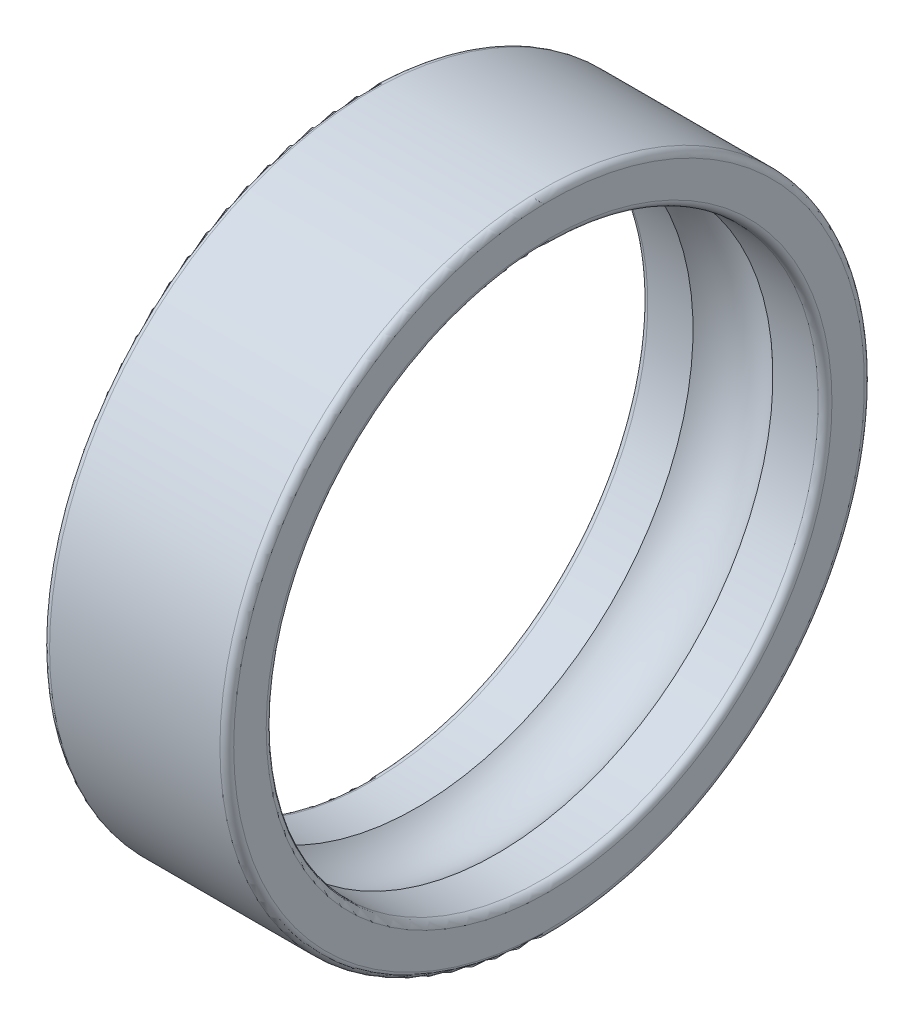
ISO-10303-21;
HEADER;
FILE_DESCRIPTION(('STEP AP214'),'2;1');
FILE_NAME('part.step','',(''),(''),'','','');
FILE_SCHEMA(('AUTOMOTIVE_DESIGN { 1 0 10303 214 1 1 1 1 }'));
ENDSEC;
DATA;
#1=APPLICATION_CONTEXT('core data for automotive mechanical design processes');
#2=APPLICATION_PROTOCOL_DEFINITION('international standard','automotive_design',2000,#1);
#3=PRODUCT_CONTEXT('',#1,'mechanical');
#4=PRODUCT('Part','Part','',(#3));
#5=PRODUCT_RELATED_PRODUCT_CATEGORY('part','',(#4));
#6=PRODUCT_DEFINITION_FORMATION('','',#4);
#7=PRODUCT_DEFINITION_CONTEXT('part definition',#1,'design');
#8=PRODUCT_DEFINITION('design','',#6,#7);
#9=PRODUCT_DEFINITION_SHAPE('','',#8);
#10=(LENGTH_UNIT() NAMED_UNIT(*) SI_UNIT(.MILLI.,.METRE.));
#11=(NAMED_UNIT(*) PLANE_ANGLE_UNIT() SI_UNIT($,.RADIAN.));
#12=(NAMED_UNIT(*) SI_UNIT($,.STERADIAN.) SOLID_ANGLE_UNIT());
#13=UNCERTAINTY_MEASURE_WITH_UNIT(LENGTH_MEASURE(1.E-05),#10,'distance_accuracy_value','');
#14=(GEOMETRIC_REPRESENTATION_CONTEXT(3) GLOBAL_UNCERTAINTY_ASSIGNED_CONTEXT((#13)) GLOBAL_UNIT_ASSIGNED_CONTEXT((#10,
#11,#12)) REPRESENTATION_CONTEXT('',''));
#15=CARTESIAN_POINT('',(0.,0.,0.));
#16=DIRECTION('',(0.,0.,1.));
#17=DIRECTION('',(1.,0.,0.));
#18=AXIS2_PLACEMENT_3D('',#15,#16,#17);
#19=CARTESIAN_POINT('',(-7.7,0.,0.));
#20=DIRECTION('',(-1.,0.,0.));
#21=DIRECTION('',(0.,0.,1.));
#22=AXIS2_PLACEMENT_3D('',#19,#20,#21);
#23=TOROIDAL_SURFACE('',#22,13.7,0.3);
#24=CARTESIAN_POINT('',(-8.,0.,0.));
#25=DIRECTION('',(-1.,0.,0.));
#26=DIRECTION('',(0.,0.,1.));
#27=AXIS2_PLACEMENT_3D('',#24,#25,#26);
#28=CIRCLE('',#27,13.7);
#29=CARTESIAN_POINT('',(-8.,0.,13.7));
#30=VERTEX_POINT('',#29);
#31=EDGE_CURVE('E388',#30,#30,#28,.T.);
#32=ORIENTED_EDGE('',*,*,#31,.F.);
#33=EDGE_LOOP('',(#32));
#34=FACE_BOUND('',#33,.T.);
#35=CARTESIAN_POINT('',(-7.7,0.,0.));
#36=DIRECTION('',(-1.,0.,0.));
#37=DIRECTION('',(0.,0.,1.));
#38=AXIS2_PLACEMENT_3D('',#35,#36,#37);
#39=CIRCLE('',#38,14.);
#40=CARTESIAN_POINT('',(-7.7,0.,14.));
#41=VERTEX_POINT('',#40);
#42=EDGE_CURVE('E10',#41,#41,#39,.T.);
#43=ORIENTED_EDGE('',*,*,#42,.T.);
#44=EDGE_LOOP('',(#43));
#45=FACE_BOUND('',#44,.T.);
#46=ADVANCED_FACE('F354',(#34,#45),#23,.T.);
#47=CARTESIAN_POINT('',(-60.,0.,0.));
#48=DIRECTION('',(-1.,0.,0.));
#49=DIRECTION('',(0.,0.,1.));
#50=AXIS2_PLACEMENT_3D('',#47,#48,#49);
#51=CYLINDRICAL_SURFACE('',#50,14.);
#52=ORIENTED_EDGE('',*,*,#42,.F.);
#53=EDGE_LOOP('',(#52));
#54=FACE_BOUND('',#53,.T.);
#55=CARTESIAN_POINT('',(-0.300000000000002,0.,0.));
#56=DIRECTION('',(-1.,0.,0.));
#57=DIRECTION('',(0.,0.,1.));
#58=AXIS2_PLACEMENT_3D('',#55,#56,#57);
#59=CIRCLE('',#58,14.);
#60=CARTESIAN_POINT('',(-0.300000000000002,0.,14.));
#61=VERTEX_POINT('',#60);
#62=EDGE_CURVE('E360',#61,#61,#59,.T.);
#63=ORIENTED_EDGE('',*,*,#62,.T.);
#64=EDGE_LOOP('',(#63));
#65=FACE_BOUND('',#64,.T.);
#66=ADVANCED_FACE('F395',(#54,#65),#51,.T.);
#67=CARTESIAN_POINT('',(-0.300000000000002,0.,0.));
#68=DIRECTION('',(-1.,0.,0.));
#69=DIRECTION('',(0.,0.,1.));
#70=AXIS2_PLACEMENT_3D('',#67,#68,#69);
#71=TOROIDAL_SURFACE('',#70,13.7,0.3);
#72=ORIENTED_EDGE('',*,*,#62,.F.);
#73=EDGE_LOOP('',(#72));
#74=FACE_BOUND('',#73,.T.);
#75=CARTESIAN_POINT('',(0.,0.,0.));
#76=DIRECTION('',(-1.,0.,0.));
#77=DIRECTION('',(0.,0.,1.));
#78=AXIS2_PLACEMENT_3D('',#75,#76,#77);
#79=CIRCLE('',#78,13.7);
#80=CARTESIAN_POINT('',(0.,0.,13.7));
#81=VERTEX_POINT('',#80);
#82=EDGE_CURVE('E364',#81,#81,#79,.T.);
#83=ORIENTED_EDGE('',*,*,#82,.T.);
#84=EDGE_LOOP('',(#83));
#85=FACE_BOUND('',#84,.T.);
#86=ADVANCED_FACE('F399',(#74,#85),#71,.T.);
#87=CARTESIAN_POINT('',(0.,13.7,0.));
#88=DIRECTION('',(-1.,0.,0.));
#89=DIRECTION('',(0.,0.,1.));
#90=AXIS2_PLACEMENT_3D('',#87,#88,#89);
#91=PLANE('',#90);
#92=ORIENTED_EDGE('',*,*,#82,.F.);
#93=EDGE_LOOP('',(#92));
#94=FACE_BOUND('',#93,.T.);
#95=CARTESIAN_POINT('',(0.,0.,0.));
#96=DIRECTION('',(-1.,0.,0.));
#97=DIRECTION('',(0.,0.,1.));
#98=AXIS2_PLACEMENT_3D('',#95,#96,#97);
#99=CIRCLE('',#98,12.2894776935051);
#100=CARTESIAN_POINT('',(0.,0.,12.2894776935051));
#101=VERTEX_POINT('',#100);
#102=EDGE_CURVE('E368',#101,#101,#99,.T.);
#103=ORIENTED_EDGE('',*,*,#102,.T.);
#104=EDGE_LOOP('',(#103));
#105=FACE_BOUND('',#104,.T.);
#106=ADVANCED_FACE('F404',(#94,#105),#91,.F.);
#107=CARTESIAN_POINT('',(-0.300000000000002,0.,0.));
#108=DIRECTION('',(-1.,0.,0.));
#109=DIRECTION('',(0.,0.,1.));
#110=AXIS2_PLACEMENT_3D('',#107,#108,#109);
#111=TOROIDAL_SURFACE('',#110,12.2894776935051,0.3);
#112=ORIENTED_EDGE('',*,*,#102,.F.);
#113=EDGE_LOOP('',(#112));
#114=FACE_BOUND('',#113,.T.);
#115=CARTESIAN_POINT('',(-0.300000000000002,0.,0.));
#116=DIRECTION('',(-1.,0.,0.));
#117=DIRECTION('',(0.,0.,1.));
#118=AXIS2_PLACEMENT_3D('',#115,#116,#117);
#119=CIRCLE('',#118,11.9894776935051);
#120=CARTESIAN_POINT('',(-0.300000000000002,0.,11.9894776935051));
#121=VERTEX_POINT('',#120);
#122=EDGE_CURVE('E373',#121,#121,#119,.T.);
#123=ORIENTED_EDGE('',*,*,#122,.T.);
#124=EDGE_LOOP('',(#123));
#125=FACE_BOUND('',#124,.T.);
#126=ADVANCED_FACE('F410',(#114,#125),#111,.T.);
#127=CARTESIAN_POINT('',(-60.,0.,0.));
#128=DIRECTION('',(-1.,0.,0.));
#129=DIRECTION('',(0.,0.,1.));
#130=AXIS2_PLACEMENT_3D('',#127,#128,#129);
#131=CYLINDRICAL_SURFACE('',#130,11.9894776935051);
#132=ORIENTED_EDGE('',*,*,#122,.F.);
#133=EDGE_LOOP('',(#132));
#134=FACE_BOUND('',#133,.T.);
#135=CARTESIAN_POINT('',(-2.26506484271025,0.,0.));
#136=DIRECTION('',(-1.,0.,0.));
#137=DIRECTION('',(0.,0.,1.));
#138=AXIS2_PLACEMENT_3D('',#135,#136,#137);
#139=CIRCLE('',#138,11.9894776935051);
#140=CARTESIAN_POINT('',(-2.26506484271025,0.,11.9894776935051));
#141=VERTEX_POINT('',#140);
#142=EDGE_CURVE('E376',#141,#141,#139,.T.);
#143=ORIENTED_EDGE('',*,*,#142,.T.);
#144=EDGE_LOOP('',(#143));
#145=FACE_BOUND('',#144,.T.);
#146=ADVANCED_FACE('F414',(#134,#145),#131,.F.);
#147=CARTESIAN_POINT('',(-4.,0.,0.));
#148=DIRECTION('',(-1.,0.,0.));
#149=DIRECTION('',(0.,0.,1.));
#150=AXIS2_PLACEMENT_3D('',#147,#148,#149);
#151=TOROIDAL_SURFACE('',#150,10.1894776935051,2.5);
#152=ORIENTED_EDGE('',*,*,#142,.F.);
#153=EDGE_LOOP('',(#152));
#154=FACE_BOUND('',#153,.T.);
#155=CARTESIAN_POINT('',(-5.73493515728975,0.,0.));
#156=DIRECTION('',(-1.,0.,0.));
#157=DIRECTION('',(0.,0.,1.));
#158=AXIS2_PLACEMENT_3D('',#155,#156,#157);
#159=CIRCLE('',#158,11.9894776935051);
#160=CARTESIAN_POINT('',(-5.73493515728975,0.,11.9894776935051));
#161=VERTEX_POINT('',#160);
#162=EDGE_CURVE('E379',#161,#161,#159,.T.);
#163=ORIENTED_EDGE('',*,*,#162,.T.);
#164=EDGE_LOOP('',(#163));
#165=FACE_BOUND('',#164,.T.);
#166=ADVANCED_FACE('F418',(#154,#165),#151,.F.);
#167=CARTESIAN_POINT('',(-60.,0.,0.));
#168=DIRECTION('',(-1.,0.,0.));
#169=DIRECTION('',(0.,0.,1.));
#170=AXIS2_PLACEMENT_3D('',#167,#168,#169);
#171=CYLINDRICAL_SURFACE('',#170,11.9894776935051);
#172=ORIENTED_EDGE('',*,*,#162,.F.);
#173=EDGE_LOOP('',(#172));
#174=FACE_BOUND('',#173,.T.);
#175=CARTESIAN_POINT('',(-7.7,0.,0.));
#176=DIRECTION('',(-1.,0.,0.));
#177=DIRECTION('',(0.,0.,1.));
#178=AXIS2_PLACEMENT_3D('',#175,#176,#177);
#179=CIRCLE('',#178,11.9894776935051);
#180=CARTESIAN_POINT('',(-7.7,0.,11.9894776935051));
#181=VERTEX_POINT('',#180);
#182=EDGE_CURVE('E382',#181,#181,#179,.T.);
#183=ORIENTED_EDGE('',*,*,#182,.T.);
#184=EDGE_LOOP('',(#183));
#185=FACE_BOUND('',#184,.T.);
#186=ADVANCED_FACE('F422',(#174,#185),#171,.F.);
#187=CARTESIAN_POINT('',(-7.7,0.,0.));
#188=DIRECTION('',(-1.,0.,0.));
#189=DIRECTION('',(0.,0.,1.));
#190=AXIS2_PLACEMENT_3D('',#187,#188,#189);
#191=TOROIDAL_SURFACE('',#190,12.2894776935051,0.3);
#192=ORIENTED_EDGE('',*,*,#182,.F.);
#193=EDGE_LOOP('',(#192));
#194=FACE_BOUND('',#193,.T.);
#195=CARTESIAN_POINT('',(-8.,0.,0.));
#196=DIRECTION('',(-1.,0.,0.));
#197=DIRECTION('',(0.,0.,1.));
#198=AXIS2_PLACEMENT_3D('',#195,#196,#197);
#199=CIRCLE('',#198,12.2894776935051);
#200=CARTESIAN_POINT('',(-8.,0.,12.2894776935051));
#201=VERTEX_POINT('',#200);
#202=EDGE_CURVE('E385',#201,#201,#199,.T.);
#203=ORIENTED_EDGE('',*,*,#202,.T.);
#204=EDGE_LOOP('',(#203));
#205=FACE_BOUND('',#204,.T.);
#206=ADVANCED_FACE('F426',(#194,#205),#191,.T.);
#207=CARTESIAN_POINT('',(-8.,13.7,0.));
#208=DIRECTION('',(1.,0.,0.));
#209=DIRECTION('',(0.,0.,-1.));
#210=AXIS2_PLACEMENT_3D('',#207,#208,#209);
#211=PLANE('',#210);
#212=ORIENTED_EDGE('',*,*,#202,.F.);
#213=EDGE_LOOP('',(#212));
#214=FACE_BOUND('',#213,.T.);
#215=ORIENTED_EDGE('',*,*,#31,.T.);
#216=EDGE_LOOP('',(#215));
#217=FACE_BOUND('',#216,.T.);
#218=ADVANCED_FACE('F392',(#214,#217),#211,.F.);
#219=CLOSED_SHELL('',(#46,#66,#86,#106,#126,#146,#166,#186,#206,#218));
#220=MANIFOLD_SOLID_BREP('B2',#219);
#221=ADVANCED_BREP_SHAPE_REPRESENTATION('',(#18,#220),#14);
#222=SHAPE_DEFINITION_REPRESENTATION(#9,#221);
ENDSEC;
END-ISO-10303-21;
